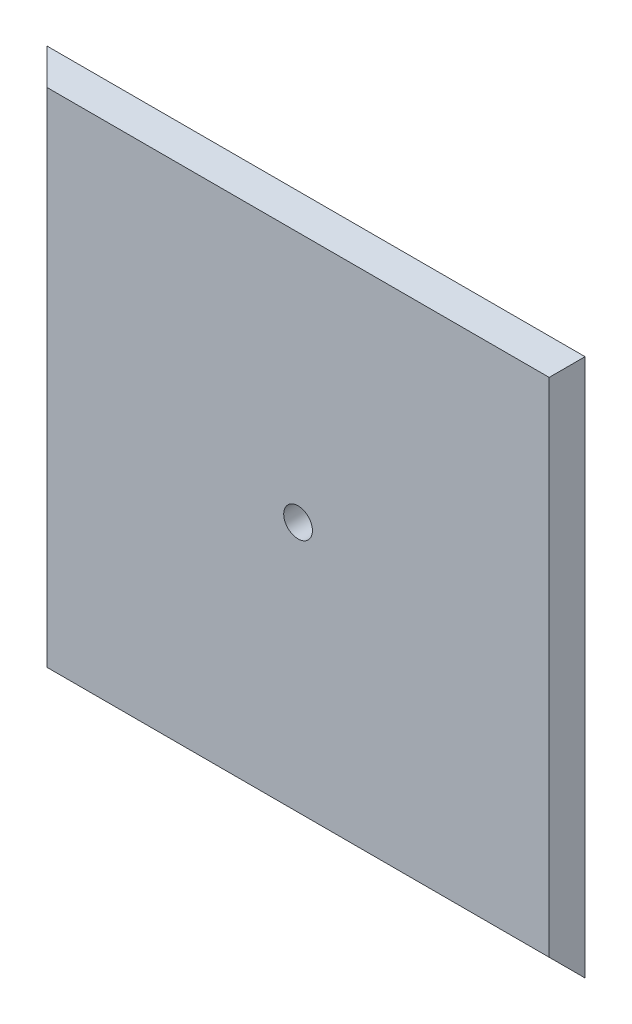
ISO-10303-21;
HEADER;
FILE_DESCRIPTION(('STEP AP214'),'2;1');
FILE_NAME('part.step','',(''),(''),'','','');
FILE_SCHEMA(('AUTOMOTIVE_DESIGN { 1 0 10303 214 1 1 1 1 }'));
ENDSEC;
DATA;
#1=APPLICATION_CONTEXT('core data for automotive mechanical design processes');
#2=APPLICATION_PROTOCOL_DEFINITION('international standard','automotive_design',2000,#1);
#3=PRODUCT_CONTEXT('',#1,'mechanical');
#4=PRODUCT('Part','Part','',(#3));
#5=PRODUCT_RELATED_PRODUCT_CATEGORY('part','',(#4));
#6=PRODUCT_DEFINITION_FORMATION('','',#4);
#7=PRODUCT_DEFINITION_CONTEXT('part definition',#1,'design');
#8=PRODUCT_DEFINITION('design','',#6,#7);
#9=PRODUCT_DEFINITION_SHAPE('','',#8);
#10=(LENGTH_UNIT() NAMED_UNIT(*) SI_UNIT(.MILLI.,.METRE.));
#11=(NAMED_UNIT(*) PLANE_ANGLE_UNIT() SI_UNIT($,.RADIAN.));
#12=(NAMED_UNIT(*) SI_UNIT($,.STERADIAN.) SOLID_ANGLE_UNIT());
#13=UNCERTAINTY_MEASURE_WITH_UNIT(LENGTH_MEASURE(1.E-05),#10,'distance_accuracy_value','');
#14=(GEOMETRIC_REPRESENTATION_CONTEXT(3) GLOBAL_UNCERTAINTY_ASSIGNED_CONTEXT((#13)) GLOBAL_UNIT_ASSIGNED_CONTEXT((#10,
#11,#12)) REPRESENTATION_CONTEXT('',''));
#15=CARTESIAN_POINT('',(0.,0.,0.));
#16=DIRECTION('',(0.,0.,1.));
#17=DIRECTION('',(1.,0.,0.));
#18=AXIS2_PLACEMENT_3D('',#15,#16,#17);
#19=CARTESIAN_POINT('',(0.,0.,10.));
#20=DIRECTION('',(0.,0.,1.));
#21=DIRECTION('',(1.,0.,0.));
#22=AXIS2_PLACEMENT_3D('',#19,#20,#21);
#23=PLANE('',#22);
#24=DIRECTION('',(0.,1.,0.));
#25=VECTOR('',#24,1.);
#26=CARTESIAN_POINT('',(70.,75.,10.));
#27=LINE('',#26,#25);
#28=CARTESIAN_POINT('',(70.,-70.,10.));
#29=VERTEX_POINT('',#28);
#30=CARTESIAN_POINT('',(70.,69.9999999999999,10.));
#31=VERTEX_POINT('',#30);
#32=EDGE_CURVE('E138',#29,#31,#27,.T.);
#33=ORIENTED_EDGE('',*,*,#32,.T.);
#34=DIRECTION('',(-1.,0.,0.));
#35=VECTOR('',#34,1.);
#36=CARTESIAN_POINT('',(-75.,70.,10.));
#37=LINE('',#36,#35);
#38=CARTESIAN_POINT('',(-70.,70.,10.));
#39=VERTEX_POINT('',#38);
#40=EDGE_CURVE('E102',#31,#39,#37,.T.);
#41=ORIENTED_EDGE('',*,*,#40,.T.);
#42=DIRECTION('',(0.,-1.,0.));
#43=VECTOR('',#42,1.);
#44=CARTESIAN_POINT('',(-69.9999999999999,-75.,10.));
#45=LINE('',#44,#43);
#46=CARTESIAN_POINT('',(-69.9999999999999,-70.,10.));
#47=VERTEX_POINT('',#46);
#48=EDGE_CURVE('E132',#39,#47,#45,.T.);
#49=ORIENTED_EDGE('',*,*,#48,.T.);
#50=DIRECTION('',(1.,0.,0.));
#51=VECTOR('',#50,1.);
#52=CARTESIAN_POINT('',(75.,-70.,10.));
#53=LINE('',#52,#51);
#54=EDGE_CURVE('E136',#47,#29,#53,.T.);
#55=ORIENTED_EDGE('',*,*,#54,.T.);
#56=EDGE_LOOP('',(#33,#41,#49,#55));
#57=FACE_BOUND('',#56,.T.);
#58=CARTESIAN_POINT('',(0.,0.,10.));
#59=DIRECTION('',(0.,0.,1.));
#60=DIRECTION('',(1.,0.,0.));
#61=AXIS2_PLACEMENT_3D('',#58,#59,#60);
#62=CIRCLE('',#61,4.);
#63=CARTESIAN_POINT('',(4.,0.,10.));
#64=VERTEX_POINT('',#63);
#65=EDGE_CURVE('E128',#64,#64,#62,.T.);
#66=ORIENTED_EDGE('',*,*,#65,.F.);
#67=EDGE_LOOP('',(#66));
#68=FACE_BOUND('',#67,.T.);
#69=ADVANCED_FACE('F34',(#57,#68),#23,.T.);
#70=CARTESIAN_POINT('',(0.,0.,0.));
#71=DIRECTION('',(0.,0.,1.));
#72=DIRECTION('',(1.,0.,0.));
#73=AXIS2_PLACEMENT_3D('',#70,#71,#72);
#74=PLANE('',#73);
#75=DIRECTION('',(0.,-1.,0.));
#76=VECTOR('',#75,1.);
#77=CARTESIAN_POINT('',(70.,0.,0.));
#78=LINE('',#77,#76);
#79=CARTESIAN_POINT('',(70.,69.9999999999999,0.));
#80=VERTEX_POINT('',#79);
#81=CARTESIAN_POINT('',(70.,-69.9999999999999,0.));
#82=VERTEX_POINT('',#81);
#83=EDGE_CURVE('E99',#80,#82,#78,.T.);
#84=ORIENTED_EDGE('',*,*,#83,.T.);
#85=DIRECTION('',(-1.,0.,0.));
#86=VECTOR('',#85,1.);
#87=CARTESIAN_POINT('',(0.,-69.9999999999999,0.));
#88=LINE('',#87,#86);
#89=CARTESIAN_POINT('',(-69.9999999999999,-69.9999999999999,0.));
#90=VERTEX_POINT('',#89);
#91=EDGE_CURVE('E11',#82,#90,#88,.T.);
#92=ORIENTED_EDGE('',*,*,#91,.T.);
#93=DIRECTION('',(0.,1.,0.));
#94=VECTOR('',#93,1.);
#95=CARTESIAN_POINT('',(-69.9999999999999,0.,0.));
#96=LINE('',#95,#94);
#97=CARTESIAN_POINT('',(-69.9999999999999,69.9999999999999,0.));
#98=VERTEX_POINT('',#97);
#99=EDGE_CURVE('E44',#90,#98,#96,.T.);
#100=ORIENTED_EDGE('',*,*,#99,.T.);
#101=DIRECTION('',(1.,0.,0.));
#102=VECTOR('',#101,1.);
#103=CARTESIAN_POINT('',(0.,69.9999999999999,0.));
#104=LINE('',#103,#102);
#105=EDGE_CURVE('E95',#98,#80,#104,.T.);
#106=ORIENTED_EDGE('',*,*,#105,.T.);
#107=EDGE_LOOP('',(#84,#92,#100,#106));
#108=FACE_BOUND('',#107,.T.);
#109=CARTESIAN_POINT('',(0.,0.,0.));
#110=DIRECTION('',(0.,0.,1.));
#111=DIRECTION('',(1.,0.,0.));
#112=AXIS2_PLACEMENT_3D('',#109,#110,#111);
#113=CIRCLE('',#112,4.);
#114=CARTESIAN_POINT('',(4.,0.,0.));
#115=VERTEX_POINT('',#114);
#116=EDGE_CURVE('E126',#115,#115,#113,.T.);
#117=ORIENTED_EDGE('',*,*,#116,.T.);
#118=EDGE_LOOP('',(#117));
#119=FACE_BOUND('',#118,.T.);
#120=ADVANCED_FACE('F97',(#108,#119),#74,.F.);
#121=CARTESIAN_POINT('',(0.,0.,10.));
#122=DIRECTION('',(0.,0.,-1.));
#123=DIRECTION('',(-1.,0.,0.));
#124=AXIS2_PLACEMENT_3D('',#121,#122,#123);
#125=CYLINDRICAL_SURFACE('',#124,4.);
#126=ORIENTED_EDGE('',*,*,#65,.T.);
#127=EDGE_LOOP('',(#126));
#128=FACE_BOUND('',#127,.T.);
#129=ORIENTED_EDGE('',*,*,#116,.F.);
#130=EDGE_LOOP('',(#129));
#131=FACE_BOUND('',#130,.T.);
#132=ADVANCED_FACE('F170',(#128,#131),#125,.F.);
#133=CARTESIAN_POINT('',(-75.,-75.,5.00000000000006));
#134=DIRECTION('',(0.,0.707106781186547,0.707106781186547));
#135=DIRECTION('',(1.,0.,0.));
#136=AXIS2_PLACEMENT_3D('',#133,#134,#135);
#137=PLANE('',#136);
#138=DIRECTION('',(-0.577350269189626,-0.577350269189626,0.577350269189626));
#139=VECTOR('',#138,1.);
#140=CARTESIAN_POINT('',(-25.,-25.,-44.9999999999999));
#141=LINE('',#140,#139);
#142=CARTESIAN_POINT('',(-75.,-75.,4.99999999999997));
#143=VERTEX_POINT('',#142);
#144=EDGE_CURVE('E117',#90,#143,#141,.T.);
#145=ORIENTED_EDGE('',*,*,#144,.F.);
#146=ORIENTED_EDGE('',*,*,#91,.F.);
#147=DIRECTION('',(-0.577350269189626,0.577350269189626,-0.577350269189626));
#148=VECTOR('',#147,1.);
#149=CARTESIAN_POINT('',(25.,-25.,-44.9999999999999));
#150=LINE('',#149,#148);
#151=CARTESIAN_POINT('',(75.,-75.,4.99999999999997));
#152=VERTEX_POINT('',#151);
#153=EDGE_CURVE('E38',#152,#82,#150,.T.);
#154=ORIENTED_EDGE('',*,*,#153,.F.);
#155=DIRECTION('',(1.,0.,0.));
#156=VECTOR('',#155,1.);
#157=CARTESIAN_POINT('',(-75.,-75.,5.00000000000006));
#158=LINE('',#157,#156);
#159=EDGE_CURVE('E69',#143,#152,#158,.T.);
#160=ORIENTED_EDGE('',*,*,#159,.F.);
#161=EDGE_LOOP('',(#145,#146,#154,#160));
#162=FACE_BOUND('',#161,.T.);
#163=ADVANCED_FACE('F36',(#162),#137,.F.);
#164=CARTESIAN_POINT('',(75.,75.,5.00000000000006));
#165=DIRECTION('',(-0.707106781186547,0.,0.707106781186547));
#166=DIRECTION('',(0.,1.,0.));
#167=AXIS2_PLACEMENT_3D('',#164,#165,#166);
#168=PLANE('',#167);
#169=ORIENTED_EDGE('',*,*,#153,.T.);
#170=ORIENTED_EDGE('',*,*,#83,.F.);
#171=DIRECTION('',(-0.577350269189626,-0.577350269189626,-0.577350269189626));
#172=VECTOR('',#171,1.);
#173=CARTESIAN_POINT('',(25.0000000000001,25.,-44.9999999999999));
#174=LINE('',#173,#172);
#175=CARTESIAN_POINT('',(75.,75.,4.99999999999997));
#176=VERTEX_POINT('',#175);
#177=EDGE_CURVE('E107',#176,#80,#174,.T.);
#178=ORIENTED_EDGE('',*,*,#177,.F.);
#179=DIRECTION('',(0.,1.,0.));
#180=VECTOR('',#179,1.);
#181=CARTESIAN_POINT('',(75.,75.,5.00000000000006));
#182=LINE('',#181,#180);
#183=EDGE_CURVE('E115',#152,#176,#182,.T.);
#184=ORIENTED_EDGE('',*,*,#183,.F.);
#185=EDGE_LOOP('',(#169,#170,#178,#184));
#186=FACE_BOUND('',#185,.T.);
#187=ADVANCED_FACE('F105',(#186),#168,.F.);
#188=CARTESIAN_POINT('',(0.,-70.,10.));
#189=DIRECTION('',(0.,-0.707106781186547,0.707106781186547));
#190=DIRECTION('',(-1.,0.,0.));
#191=AXIS2_PLACEMENT_3D('',#188,#189,#190);
#192=PLANE('',#191);
#193=DIRECTION('',(0.577350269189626,0.577350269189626,0.577350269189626));
#194=VECTOR('',#193,1.);
#195=CARTESIAN_POINT('',(-46.6666666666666,-46.6666666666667,33.3333333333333));
#196=LINE('',#195,#194);
#197=EDGE_CURVE('E150',#143,#47,#196,.T.);
#198=ORIENTED_EDGE('',*,*,#197,.F.);
#199=ORIENTED_EDGE('',*,*,#159,.T.);
#200=DIRECTION('',(-0.577350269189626,0.577350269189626,0.577350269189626));
#201=VECTOR('',#200,1.);
#202=CARTESIAN_POINT('',(46.6666666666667,-46.6666666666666,33.3333333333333));
#203=LINE('',#202,#201);
#204=EDGE_CURVE('E119',#29,#152,#203,.F.);
#205=ORIENTED_EDGE('',*,*,#204,.F.);
#206=ORIENTED_EDGE('',*,*,#54,.F.);
#207=EDGE_LOOP('',(#198,#199,#205,#206));
#208=FACE_BOUND('',#207,.T.);
#209=ADVANCED_FACE('F158',(#208),#192,.T.);
#210=CARTESIAN_POINT('',(-75.,75.,5.00000000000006));
#211=DIRECTION('',(0.707106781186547,0.,0.707106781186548));
#212=DIRECTION('',(0.,-1.,0.));
#213=AXIS2_PLACEMENT_3D('',#210,#211,#212);
#214=PLANE('',#213);
#215=DIRECTION('',(-0.577350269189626,0.577350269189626,0.577350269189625));
#216=VECTOR('',#215,1.);
#217=CARTESIAN_POINT('',(-75.,75.,5.00000000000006));
#218=LINE('',#217,#216);
#219=CARTESIAN_POINT('',(-75.,75.,4.99999999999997));
#220=VERTEX_POINT('',#219);
#221=EDGE_CURVE('E114',#98,#220,#218,.T.);
#222=ORIENTED_EDGE('',*,*,#221,.F.);
#223=ORIENTED_EDGE('',*,*,#99,.F.);
#224=ORIENTED_EDGE('',*,*,#144,.T.);
#225=DIRECTION('',(0.,-1.,0.));
#226=VECTOR('',#225,1.);
#227=CARTESIAN_POINT('',(-75.,75.,5.00000000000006));
#228=LINE('',#227,#226);
#229=EDGE_CURVE('E147',#220,#143,#228,.T.);
#230=ORIENTED_EDGE('',*,*,#229,.F.);
#231=EDGE_LOOP('',(#222,#223,#224,#230));
#232=FACE_BOUND('',#231,.T.);
#233=ADVANCED_FACE('F163',(#232),#214,.F.);
#234=CARTESIAN_POINT('',(-75.,75.,5.00000000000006));
#235=DIRECTION('',(0.,-0.707106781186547,0.707106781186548));
#236=DIRECTION('',(-1.,0.,0.));
#237=AXIS2_PLACEMENT_3D('',#234,#235,#236);
#238=PLANE('',#237);
#239=ORIENTED_EDGE('',*,*,#105,.F.);
#240=ORIENTED_EDGE('',*,*,#221,.T.);
#241=DIRECTION('',(-1.,0.,0.));
#242=VECTOR('',#241,1.);
#243=CARTESIAN_POINT('',(-75.,75.,5.00000000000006));
#244=LINE('',#243,#242);
#245=EDGE_CURVE('E112',#176,#220,#244,.T.);
#246=ORIENTED_EDGE('',*,*,#245,.F.);
#247=ORIENTED_EDGE('',*,*,#177,.T.);
#248=EDGE_LOOP('',(#239,#240,#246,#247));
#249=FACE_BOUND('',#248,.T.);
#250=ADVANCED_FACE('F111',(#249),#238,.F.);
#251=CARTESIAN_POINT('',(70.,0.,10.));
#252=DIRECTION('',(0.707106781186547,0.,0.707106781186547));
#253=DIRECTION('',(0.,-1.,0.));
#254=AXIS2_PLACEMENT_3D('',#251,#252,#253);
#255=PLANE('',#254);
#256=ORIENTED_EDGE('',*,*,#204,.T.);
#257=ORIENTED_EDGE('',*,*,#183,.T.);
#258=DIRECTION('',(-0.577350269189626,-0.577350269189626,0.577350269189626));
#259=VECTOR('',#258,1.);
#260=CARTESIAN_POINT('',(46.6666666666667,46.6666666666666,33.3333333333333));
#261=LINE('',#260,#259);
#262=EDGE_CURVE('E144',#31,#176,#261,.F.);
#263=ORIENTED_EDGE('',*,*,#262,.F.);
#264=ORIENTED_EDGE('',*,*,#32,.F.);
#265=EDGE_LOOP('',(#256,#257,#263,#264));
#266=FACE_BOUND('',#265,.T.);
#267=ADVANCED_FACE('F155',(#266),#255,.T.);
#268=CARTESIAN_POINT('',(-70.,0.,10.));
#269=DIRECTION('',(-0.707106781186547,0.,0.707106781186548));
#270=DIRECTION('',(0.,1.,0.));
#271=AXIS2_PLACEMENT_3D('',#268,#269,#270);
#272=PLANE('',#271);
#273=ORIENTED_EDGE('',*,*,#197,.T.);
#274=ORIENTED_EDGE('',*,*,#48,.F.);
#275=DIRECTION('',(-0.577350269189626,0.577350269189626,-0.577350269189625));
#276=VECTOR('',#275,1.);
#277=CARTESIAN_POINT('',(-46.6666666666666,46.6666666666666,33.3333333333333));
#278=LINE('',#277,#276);
#279=EDGE_CURVE('E80',#220,#39,#278,.F.);
#280=ORIENTED_EDGE('',*,*,#279,.F.);
#281=ORIENTED_EDGE('',*,*,#229,.T.);
#282=EDGE_LOOP('',(#273,#274,#280,#281));
#283=FACE_BOUND('',#282,.T.);
#284=ADVANCED_FACE('F161',(#283),#272,.T.);
#285=CARTESIAN_POINT('',(0.,70.,10.));
#286=DIRECTION('',(0.,0.707106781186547,0.707106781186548));
#287=DIRECTION('',(1.,0.,0.));
#288=AXIS2_PLACEMENT_3D('',#285,#286,#287);
#289=PLANE('',#288);
#290=ORIENTED_EDGE('',*,*,#262,.T.);
#291=ORIENTED_EDGE('',*,*,#245,.T.);
#292=ORIENTED_EDGE('',*,*,#279,.T.);
#293=ORIENTED_EDGE('',*,*,#40,.F.);
#294=EDGE_LOOP('',(#290,#291,#292,#293));
#295=FACE_BOUND('',#294,.T.);
#296=ADVANCED_FACE('F164',(#295),#289,.T.);
#297=CLOSED_SHELL('',(#69,#120,#132,#163,#187,#209,#233,#250,#267,#284,#296));
#298=MANIFOLD_SOLID_BREP('B2',#297);
#299=ADVANCED_BREP_SHAPE_REPRESENTATION('',(#18,#298),#14);
#300=SHAPE_DEFINITION_REPRESENTATION(#9,#299);
ENDSEC;
END-ISO-10303-21;
